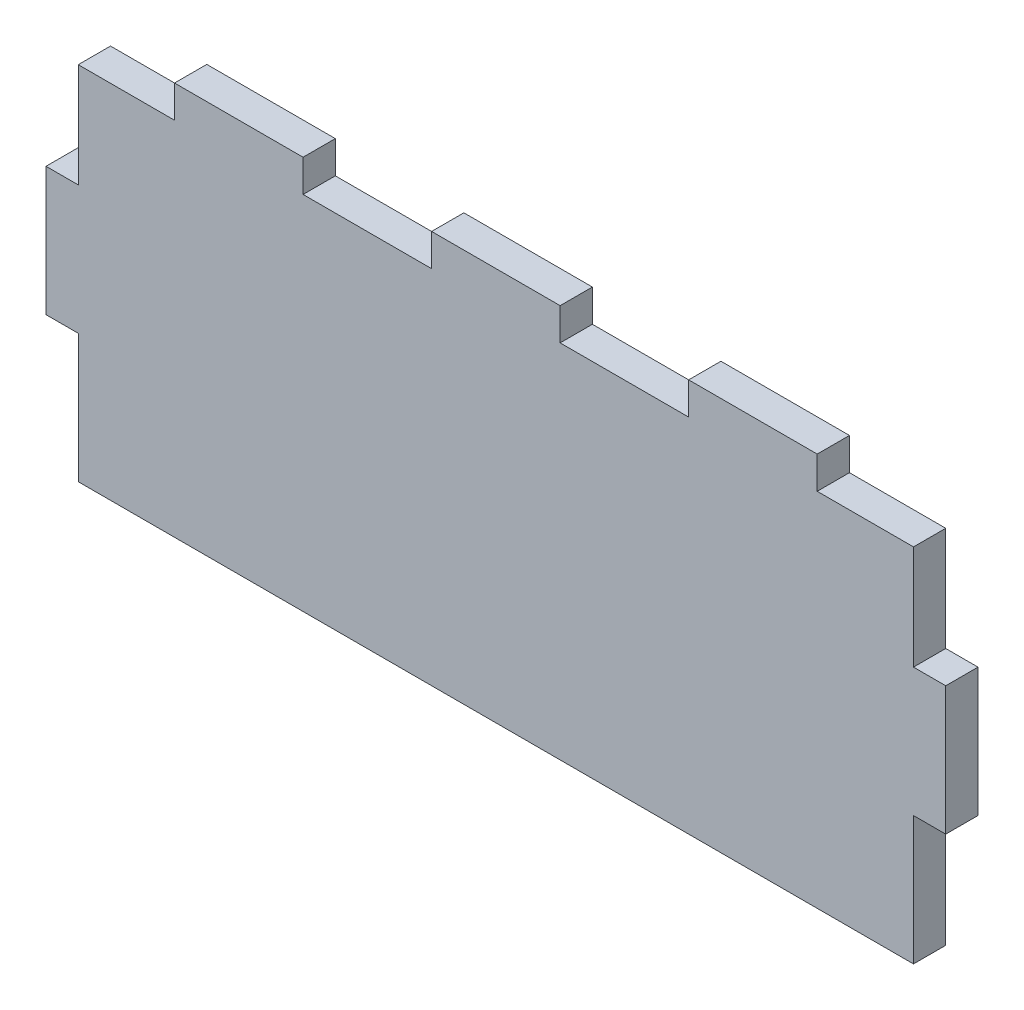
ISO-10303-21;
HEADER;
FILE_DESCRIPTION(('STEP AP214'),'2;1');
FILE_NAME('part.step','',(''),(''),'','','');
FILE_SCHEMA(('AUTOMOTIVE_DESIGN { 1 0 10303 214 1 1 1 1 }'));
ENDSEC;
DATA;
#1=APPLICATION_CONTEXT('core data for automotive mechanical design processes');
#2=APPLICATION_PROTOCOL_DEFINITION('international standard','automotive_design',2000,#1);
#3=PRODUCT_CONTEXT('',#1,'mechanical');
#4=PRODUCT('Part','Part','',(#3));
#5=PRODUCT_RELATED_PRODUCT_CATEGORY('part','',(#4));
#6=PRODUCT_DEFINITION_FORMATION('','',#4);
#7=PRODUCT_DEFINITION_CONTEXT('part definition',#1,'design');
#8=PRODUCT_DEFINITION('design','',#6,#7);
#9=PRODUCT_DEFINITION_SHAPE('','',#8);
#10=(LENGTH_UNIT() NAMED_UNIT(*) SI_UNIT(.MILLI.,.METRE.));
#11=(NAMED_UNIT(*) PLANE_ANGLE_UNIT() SI_UNIT($,.RADIAN.));
#12=(NAMED_UNIT(*) SI_UNIT($,.STERADIAN.) SOLID_ANGLE_UNIT());
#13=UNCERTAINTY_MEASURE_WITH_UNIT(LENGTH_MEASURE(1.E-05),#10,'distance_accuracy_value','');
#14=(GEOMETRIC_REPRESENTATION_CONTEXT(3) GLOBAL_UNCERTAINTY_ASSIGNED_CONTEXT((#13)) GLOBAL_UNIT_ASSIGNED_CONTEXT((#10,
#11,#12)) REPRESENTATION_CONTEXT('',''));
#15=CARTESIAN_POINT('',(0.,0.,0.));
#16=DIRECTION('',(0.,0.,1.));
#17=DIRECTION('',(1.,0.,0.));
#18=AXIS2_PLACEMENT_3D('',#15,#16,#17);
#19=CARTESIAN_POINT('',(-269.798887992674,150.110299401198,19.));
#20=DIRECTION('',(0.,-1.,0.));
#21=DIRECTION('',(1.,0.,0.));
#22=AXIS2_PLACEMENT_3D('',#19,#20,#21);
#23=PLANE('',#22);
#24=DIRECTION('',(-1.,0.,0.));
#25=VECTOR('',#24,1.);
#26=CARTESIAN_POINT('',(-269.798887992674,150.110299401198,0.));
#27=LINE('',#26,#25);
#28=CARTESIAN_POINT('',(-213.084601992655,150.110299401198,0.));
#29=VERTEX_POINT('',#28);
#30=CARTESIAN_POINT('',(-269.798887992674,150.110299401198,0.));
#31=VERTEX_POINT('',#30);
#32=EDGE_CURVE('E225',#29,#31,#27,.T.);
#33=ORIENTED_EDGE('',*,*,#32,.T.);
#34=DIRECTION('',(0.,0.,-1.));
#35=VECTOR('',#34,1.);
#36=CARTESIAN_POINT('',(-269.798887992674,150.110299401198,19.));
#37=LINE('',#36,#35);
#38=CARTESIAN_POINT('',(-269.798887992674,150.110299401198,19.));
#39=VERTEX_POINT('',#38);
#40=EDGE_CURVE('E11',#39,#31,#37,.T.);
#41=ORIENTED_EDGE('',*,*,#40,.F.);
#42=DIRECTION('',(-1.,0.,0.));
#43=VECTOR('',#42,1.);
#44=CARTESIAN_POINT('',(-269.798887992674,150.110299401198,19.));
#45=LINE('',#44,#43);
#46=CARTESIAN_POINT('',(-213.084601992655,150.110299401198,19.));
#47=VERTEX_POINT('',#46);
#48=EDGE_CURVE('E271',#47,#39,#45,.T.);
#49=ORIENTED_EDGE('',*,*,#48,.F.);
#50=DIRECTION('',(0.,0.,-1.));
#51=VECTOR('',#50,1.);
#52=CARTESIAN_POINT('',(-213.084601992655,150.110299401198,19.));
#53=LINE('',#52,#51);
#54=EDGE_CURVE('E221',#47,#29,#53,.T.);
#55=ORIENTED_EDGE('',*,*,#54,.T.);
#56=EDGE_LOOP('',(#33,#41,#49,#55));
#57=FACE_BOUND('',#56,.T.);
#58=ADVANCED_FACE('F33',(#57),#23,.F.);
#59=CARTESIAN_POINT('',(-269.798887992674,150.110299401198,19.));
#60=DIRECTION('',(1.,0.,0.));
#61=DIRECTION('',(0.,0.,-1.));
#62=AXIS2_PLACEMENT_3D('',#59,#60,#61);
#63=PLANE('',#62);
#64=DIRECTION('',(0.,-1.,0.));
#65=VECTOR('',#64,1.);
#66=CARTESIAN_POINT('',(-269.798887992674,150.110299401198,0.));
#67=LINE('',#66,#65);
#68=CARTESIAN_POINT('',(-269.798887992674,88.7788714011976,0.));
#69=VERTEX_POINT('',#68);
#70=EDGE_CURVE('E228',#31,#69,#67,.T.);
#71=ORIENTED_EDGE('',*,*,#70,.T.);
#72=DIRECTION('',(0.,0.,-1.));
#73=VECTOR('',#72,1.);
#74=CARTESIAN_POINT('',(-269.798887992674,88.7788714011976,19.));
#75=LINE('',#74,#73);
#76=CARTESIAN_POINT('',(-269.798887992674,88.7788714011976,19.));
#77=VERTEX_POINT('',#76);
#78=EDGE_CURVE('E41',#77,#69,#75,.T.);
#79=ORIENTED_EDGE('',*,*,#78,.F.);
#80=DIRECTION('',(0.,-1.,0.));
#81=VECTOR('',#80,1.);
#82=CARTESIAN_POINT('',(-269.798887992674,150.110299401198,19.));
#83=LINE('',#82,#81);
#84=EDGE_CURVE('E140',#39,#77,#83,.T.);
#85=ORIENTED_EDGE('',*,*,#84,.F.);
#86=ORIENTED_EDGE('',*,*,#40,.T.);
#87=EDGE_LOOP('',(#71,#79,#85,#86));
#88=FACE_BOUND('',#87,.T.);
#89=ADVANCED_FACE('F409',(#88),#63,.F.);
#90=CARTESIAN_POINT('',(-288.798887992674,88.7788714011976,19.));
#91=DIRECTION('',(0.,-1.,0.));
#92=DIRECTION('',(0.,0.,-1.));
#93=AXIS2_PLACEMENT_3D('',#90,#91,#92);
#94=PLANE('',#93);
#95=DIRECTION('',(-1.,0.,0.));
#96=VECTOR('',#95,1.);
#97=CARTESIAN_POINT('',(-288.798887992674,88.7788714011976,0.));
#98=LINE('',#97,#96);
#99=CARTESIAN_POINT('',(-288.798887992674,88.7788714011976,0.));
#100=VERTEX_POINT('',#99);
#101=EDGE_CURVE('E230',#69,#100,#98,.T.);
#102=ORIENTED_EDGE('',*,*,#101,.T.);
#103=DIRECTION('',(0.,0.,-1.));
#104=VECTOR('',#103,1.);
#105=CARTESIAN_POINT('',(-288.798887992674,88.7788714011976,19.));
#106=LINE('',#105,#104);
#107=CARTESIAN_POINT('',(-288.798887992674,88.7788714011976,19.));
#108=VERTEX_POINT('',#107);
#109=EDGE_CURVE('E326',#108,#100,#106,.T.);
#110=ORIENTED_EDGE('',*,*,#109,.F.);
#111=DIRECTION('',(-1.,0.,0.));
#112=VECTOR('',#111,1.);
#113=CARTESIAN_POINT('',(-288.798887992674,88.7788714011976,19.));
#114=LINE('',#113,#112);
#115=EDGE_CURVE('E334',#77,#108,#114,.T.);
#116=ORIENTED_EDGE('',*,*,#115,.F.);
#117=ORIENTED_EDGE('',*,*,#78,.T.);
#118=EDGE_LOOP('',(#102,#110,#116,#117));
#119=FACE_BOUND('',#118,.T.);
#120=ADVANCED_FACE('F332',(#119),#94,.F.);
#121=CARTESIAN_POINT('',(-288.798887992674,88.7788714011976,19.));
#122=DIRECTION('',(1.,0.,0.));
#123=DIRECTION('',(0.,0.,-1.));
#124=AXIS2_PLACEMENT_3D('',#121,#122,#123);
#125=PLANE('',#124);
#126=DIRECTION('',(0.,-1.,0.));
#127=VECTOR('',#126,1.);
#128=CARTESIAN_POINT('',(-288.798887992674,88.7788714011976,0.));
#129=LINE('',#128,#127);
#130=CARTESIAN_POINT('',(-288.798887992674,13.0645854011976,0.));
#131=VERTEX_POINT('',#130);
#132=EDGE_CURVE('E232',#100,#131,#129,.T.);
#133=ORIENTED_EDGE('',*,*,#132,.T.);
#134=DIRECTION('',(0.,0.,-1.));
#135=VECTOR('',#134,1.);
#136=CARTESIAN_POINT('',(-288.798887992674,13.0645854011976,19.));
#137=LINE('',#136,#135);
#138=CARTESIAN_POINT('',(-288.798887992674,13.0645854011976,19.));
#139=VERTEX_POINT('',#138);
#140=EDGE_CURVE('E323',#139,#131,#137,.T.);
#141=ORIENTED_EDGE('',*,*,#140,.F.);
#142=DIRECTION('',(0.,-1.,0.));
#143=VECTOR('',#142,1.);
#144=CARTESIAN_POINT('',(-288.798887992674,88.7788714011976,19.));
#145=LINE('',#144,#143);
#146=EDGE_CURVE('E352',#108,#139,#145,.T.);
#147=ORIENTED_EDGE('',*,*,#146,.F.);
#148=ORIENTED_EDGE('',*,*,#109,.T.);
#149=EDGE_LOOP('',(#133,#141,#147,#148));
#150=FACE_BOUND('',#149,.T.);
#151=ADVANCED_FACE('F343',(#150),#125,.F.);
#152=CARTESIAN_POINT('',(-288.798887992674,13.0645854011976,19.));
#153=DIRECTION('',(0.,1.,0.));
#154=DIRECTION('',(0.,0.,1.));
#155=AXIS2_PLACEMENT_3D('',#152,#153,#154);
#156=PLANE('',#155);
#157=DIRECTION('',(1.,0.,0.));
#158=VECTOR('',#157,1.);
#159=CARTESIAN_POINT('',(-288.798887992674,13.0645854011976,0.));
#160=LINE('',#159,#158);
#161=CARTESIAN_POINT('',(-269.798887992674,13.0645854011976,0.));
#162=VERTEX_POINT('',#161);
#163=EDGE_CURVE('E234',#131,#162,#160,.T.);
#164=ORIENTED_EDGE('',*,*,#163,.T.);
#165=DIRECTION('',(0.,0.,-1.));
#166=VECTOR('',#165,1.);
#167=CARTESIAN_POINT('',(-269.798887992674,13.0645854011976,19.));
#168=LINE('',#167,#166);
#169=CARTESIAN_POINT('',(-269.798887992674,13.0645854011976,19.));
#170=VERTEX_POINT('',#169);
#171=EDGE_CURVE('E320',#170,#162,#168,.T.);
#172=ORIENTED_EDGE('',*,*,#171,.F.);
#173=DIRECTION('',(1.,0.,0.));
#174=VECTOR('',#173,1.);
#175=CARTESIAN_POINT('',(-288.798887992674,13.0645854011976,19.));
#176=LINE('',#175,#174);
#177=EDGE_CURVE('E349',#139,#170,#176,.T.);
#178=ORIENTED_EDGE('',*,*,#177,.F.);
#179=ORIENTED_EDGE('',*,*,#140,.T.);
#180=EDGE_LOOP('',(#164,#172,#178,#179));
#181=FACE_BOUND('',#180,.T.);
#182=ADVANCED_FACE('F347',(#181),#156,.F.);
#183=CARTESIAN_POINT('',(-269.798887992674,13.0645854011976,19.));
#184=DIRECTION('',(1.,0.,0.));
#185=DIRECTION('',(0.,0.,-1.));
#186=AXIS2_PLACEMENT_3D('',#183,#184,#185);
#187=PLANE('',#186);
#188=DIRECTION('',(0.,-1.,0.));
#189=VECTOR('',#188,1.);
#190=CARTESIAN_POINT('',(-269.798887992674,13.0645854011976,0.));
#191=LINE('',#190,#189);
#192=CARTESIAN_POINT('',(-269.798887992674,-62.6497005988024,0.));
#193=VERTEX_POINT('',#192);
#194=EDGE_CURVE('E236',#162,#193,#191,.T.);
#195=ORIENTED_EDGE('',*,*,#194,.T.);
#196=DIRECTION('',(0.,0.,-1.));
#197=VECTOR('',#196,1.);
#198=CARTESIAN_POINT('',(-269.798887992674,-62.6497005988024,19.));
#199=LINE('',#198,#197);
#200=CARTESIAN_POINT('',(-269.798887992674,-62.6497005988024,19.));
#201=VERTEX_POINT('',#200);
#202=EDGE_CURVE('E317',#201,#193,#199,.T.);
#203=ORIENTED_EDGE('',*,*,#202,.F.);
#204=DIRECTION('',(0.,-1.,0.));
#205=VECTOR('',#204,1.);
#206=CARTESIAN_POINT('',(-269.798887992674,13.0645854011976,19.));
#207=LINE('',#206,#205);
#208=EDGE_CURVE('E351',#170,#201,#207,.T.);
#209=ORIENTED_EDGE('',*,*,#208,.F.);
#210=ORIENTED_EDGE('',*,*,#171,.T.);
#211=EDGE_LOOP('',(#195,#203,#209,#210));
#212=FACE_BOUND('',#211,.T.);
#213=ADVANCED_FACE('F422',(#212),#187,.F.);
#214=CARTESIAN_POINT('',(-269.798887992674,-62.6497005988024,19.));
#215=DIRECTION('',(0.,1.,0.));
#216=DIRECTION('',(-1.,0.,0.));
#217=AXIS2_PLACEMENT_3D('',#214,#215,#216);
#218=PLANE('',#217);
#219=DIRECTION('',(1.,0.,0.));
#220=VECTOR('',#219,1.);
#221=CARTESIAN_POINT('',(-269.798887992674,-62.6497005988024,0.));
#222=LINE('',#221,#220);
#223=CARTESIAN_POINT('',(222.201114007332,-62.6497005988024,0.));
#224=VERTEX_POINT('',#223);
#225=EDGE_CURVE('E238',#193,#224,#222,.T.);
#226=ORIENTED_EDGE('',*,*,#225,.T.);
#227=DIRECTION('',(0.,0.,-1.));
#228=VECTOR('',#227,1.);
#229=CARTESIAN_POINT('',(222.201114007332,-62.6497005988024,19.));
#230=LINE('',#229,#228);
#231=CARTESIAN_POINT('',(222.201114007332,-62.6497005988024,19.));
#232=VERTEX_POINT('',#231);
#233=EDGE_CURVE('E314',#232,#224,#230,.T.);
#234=ORIENTED_EDGE('',*,*,#233,.F.);
#235=DIRECTION('',(1.,0.,0.));
#236=VECTOR('',#235,1.);
#237=CARTESIAN_POINT('',(-269.798887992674,-62.6497005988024,19.));
#238=LINE('',#237,#236);
#239=EDGE_CURVE('E354',#201,#232,#238,.T.);
#240=ORIENTED_EDGE('',*,*,#239,.F.);
#241=ORIENTED_EDGE('',*,*,#202,.T.);
#242=EDGE_LOOP('',(#226,#234,#240,#241));
#243=FACE_BOUND('',#242,.T.);
#244=ADVANCED_FACE('F425',(#243),#218,.F.);
#245=CARTESIAN_POINT('',(222.201114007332,13.0645854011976,19.));
#246=DIRECTION('',(-1.,0.,0.));
#247=DIRECTION('',(0.,0.,1.));
#248=AXIS2_PLACEMENT_3D('',#245,#246,#247);
#249=PLANE('',#248);
#250=DIRECTION('',(0.,1.,0.));
#251=VECTOR('',#250,1.);
#252=CARTESIAN_POINT('',(222.201114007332,13.0645854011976,0.));
#253=LINE('',#252,#251);
#254=CARTESIAN_POINT('',(222.201114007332,13.0645854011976,0.));
#255=VERTEX_POINT('',#254);
#256=EDGE_CURVE('E240',#224,#255,#253,.T.);
#257=ORIENTED_EDGE('',*,*,#256,.T.);
#258=DIRECTION('',(0.,0.,-1.));
#259=VECTOR('',#258,1.);
#260=CARTESIAN_POINT('',(222.201114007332,13.0645854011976,19.));
#261=LINE('',#260,#259);
#262=CARTESIAN_POINT('',(222.201114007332,13.0645854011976,19.));
#263=VERTEX_POINT('',#262);
#264=EDGE_CURVE('E311',#263,#255,#261,.T.);
#265=ORIENTED_EDGE('',*,*,#264,.F.);
#266=DIRECTION('',(0.,1.,0.));
#267=VECTOR('',#266,1.);
#268=CARTESIAN_POINT('',(222.201114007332,13.0645854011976,19.));
#269=LINE('',#268,#267);
#270=EDGE_CURVE('E360',#232,#263,#269,.T.);
#271=ORIENTED_EDGE('',*,*,#270,.F.);
#272=ORIENTED_EDGE('',*,*,#233,.T.);
#273=EDGE_LOOP('',(#257,#265,#271,#272));
#274=FACE_BOUND('',#273,.T.);
#275=ADVANCED_FACE('F429',(#274),#249,.F.);
#276=CARTESIAN_POINT('',(222.201114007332,13.0645854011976,19.));
#277=DIRECTION('',(0.,1.,0.));
#278=DIRECTION('',(0.,0.,1.));
#279=AXIS2_PLACEMENT_3D('',#276,#277,#278);
#280=PLANE('',#279);
#281=DIRECTION('',(1.,0.,0.));
#282=VECTOR('',#281,1.);
#283=CARTESIAN_POINT('',(222.201114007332,13.0645854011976,0.));
#284=LINE('',#283,#282);
#285=CARTESIAN_POINT('',(241.201114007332,13.0645854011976,0.));
#286=VERTEX_POINT('',#285);
#287=EDGE_CURVE('E242',#255,#286,#284,.T.);
#288=ORIENTED_EDGE('',*,*,#287,.T.);
#289=DIRECTION('',(0.,0.,-1.));
#290=VECTOR('',#289,1.);
#291=CARTESIAN_POINT('',(241.201114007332,13.0645854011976,19.));
#292=LINE('',#291,#290);
#293=CARTESIAN_POINT('',(241.201114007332,13.0645854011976,19.));
#294=VERTEX_POINT('',#293);
#295=EDGE_CURVE('E308',#294,#286,#292,.T.);
#296=ORIENTED_EDGE('',*,*,#295,.F.);
#297=DIRECTION('',(1.,0.,0.));
#298=VECTOR('',#297,1.);
#299=CARTESIAN_POINT('',(222.201114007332,13.0645854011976,19.));
#300=LINE('',#299,#298);
#301=EDGE_CURVE('E362',#263,#294,#300,.T.);
#302=ORIENTED_EDGE('',*,*,#301,.F.);
#303=ORIENTED_EDGE('',*,*,#264,.T.);
#304=EDGE_LOOP('',(#288,#296,#302,#303));
#305=FACE_BOUND('',#304,.T.);
#306=ADVANCED_FACE('F433',(#305),#280,.F.);
#307=CARTESIAN_POINT('',(241.201114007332,88.7788714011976,19.));
#308=DIRECTION('',(-1.,0.,0.));
#309=DIRECTION('',(0.,0.,1.));
#310=AXIS2_PLACEMENT_3D('',#307,#308,#309);
#311=PLANE('',#310);
#312=DIRECTION('',(0.,1.,0.));
#313=VECTOR('',#312,1.);
#314=CARTESIAN_POINT('',(241.201114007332,88.7788714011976,0.));
#315=LINE('',#314,#313);
#316=CARTESIAN_POINT('',(241.201114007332,88.7788714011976,0.));
#317=VERTEX_POINT('',#316);
#318=EDGE_CURVE('E244',#286,#317,#315,.T.);
#319=ORIENTED_EDGE('',*,*,#318,.T.);
#320=DIRECTION('',(0.,0.,-1.));
#321=VECTOR('',#320,1.);
#322=CARTESIAN_POINT('',(241.201114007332,88.7788714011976,19.));
#323=LINE('',#322,#321);
#324=CARTESIAN_POINT('',(241.201114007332,88.7788714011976,19.));
#325=VERTEX_POINT('',#324);
#326=EDGE_CURVE('E305',#325,#317,#323,.T.);
#327=ORIENTED_EDGE('',*,*,#326,.F.);
#328=DIRECTION('',(0.,1.,0.));
#329=VECTOR('',#328,1.);
#330=CARTESIAN_POINT('',(241.201114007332,88.7788714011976,19.));
#331=LINE('',#330,#329);
#332=EDGE_CURVE('E364',#294,#325,#331,.T.);
#333=ORIENTED_EDGE('',*,*,#332,.F.);
#334=ORIENTED_EDGE('',*,*,#295,.T.);
#335=EDGE_LOOP('',(#319,#327,#333,#334));
#336=FACE_BOUND('',#335,.T.);
#337=ADVANCED_FACE('F437',(#336),#311,.F.);
#338=CARTESIAN_POINT('',(222.201114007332,88.7788714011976,19.));
#339=DIRECTION('',(0.,-1.,0.));
#340=DIRECTION('',(0.,0.,-1.));
#341=AXIS2_PLACEMENT_3D('',#338,#339,#340);
#342=PLANE('',#341);
#343=DIRECTION('',(-1.,0.,0.));
#344=VECTOR('',#343,1.);
#345=CARTESIAN_POINT('',(222.201114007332,88.7788714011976,0.));
#346=LINE('',#345,#344);
#347=CARTESIAN_POINT('',(222.201114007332,88.7788714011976,0.));
#348=VERTEX_POINT('',#347);
#349=EDGE_CURVE('E246',#317,#348,#346,.T.);
#350=ORIENTED_EDGE('',*,*,#349,.T.);
#351=DIRECTION('',(0.,0.,-1.));
#352=VECTOR('',#351,1.);
#353=CARTESIAN_POINT('',(222.201114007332,88.7788714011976,19.));
#354=LINE('',#353,#352);
#355=CARTESIAN_POINT('',(222.201114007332,88.7788714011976,19.));
#356=VERTEX_POINT('',#355);
#357=EDGE_CURVE('E302',#356,#348,#354,.T.);
#358=ORIENTED_EDGE('',*,*,#357,.F.);
#359=DIRECTION('',(-1.,0.,0.));
#360=VECTOR('',#359,1.);
#361=CARTESIAN_POINT('',(222.201114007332,88.7788714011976,19.));
#362=LINE('',#361,#360);
#363=EDGE_CURVE('E366',#325,#356,#362,.T.);
#364=ORIENTED_EDGE('',*,*,#363,.F.);
#365=ORIENTED_EDGE('',*,*,#326,.T.);
#366=EDGE_LOOP('',(#350,#358,#364,#365));
#367=FACE_BOUND('',#366,.T.);
#368=ADVANCED_FACE('F441',(#367),#342,.F.);
#369=CARTESIAN_POINT('',(222.201114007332,150.110299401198,19.));
#370=DIRECTION('',(-1.,0.,0.));
#371=DIRECTION('',(0.,0.,1.));
#372=AXIS2_PLACEMENT_3D('',#369,#370,#371);
#373=PLANE('',#372);
#374=DIRECTION('',(0.,1.,0.));
#375=VECTOR('',#374,1.);
#376=CARTESIAN_POINT('',(222.201114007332,150.110299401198,0.));
#377=LINE('',#376,#375);
#378=CARTESIAN_POINT('',(222.201114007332,150.110299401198,0.));
#379=VERTEX_POINT('',#378);
#380=EDGE_CURVE('E248',#348,#379,#377,.T.);
#381=ORIENTED_EDGE('',*,*,#380,.T.);
#382=DIRECTION('',(0.,0.,-1.));
#383=VECTOR('',#382,1.);
#384=CARTESIAN_POINT('',(222.201114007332,150.110299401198,19.));
#385=LINE('',#384,#383);
#386=CARTESIAN_POINT('',(222.201114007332,150.110299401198,19.));
#387=VERTEX_POINT('',#386);
#388=EDGE_CURVE('E299',#387,#379,#385,.T.);
#389=ORIENTED_EDGE('',*,*,#388,.F.);
#390=DIRECTION('',(0.,1.,0.));
#391=VECTOR('',#390,1.);
#392=CARTESIAN_POINT('',(222.201114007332,150.110299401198,19.));
#393=LINE('',#392,#391);
#394=EDGE_CURVE('E368',#356,#387,#393,.T.);
#395=ORIENTED_EDGE('',*,*,#394,.F.);
#396=ORIENTED_EDGE('',*,*,#357,.T.);
#397=EDGE_LOOP('',(#381,#389,#395,#396));
#398=FACE_BOUND('',#397,.T.);
#399=ADVANCED_FACE('F445',(#398),#373,.F.);
#400=CARTESIAN_POINT('',(165.486828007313,150.110299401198,19.));
#401=DIRECTION('',(0.,-1.,0.));
#402=DIRECTION('',(0.,0.,-1.));
#403=AXIS2_PLACEMENT_3D('',#400,#401,#402);
#404=PLANE('',#403);
#405=DIRECTION('',(-1.,0.,0.));
#406=VECTOR('',#405,1.);
#407=CARTESIAN_POINT('',(165.486828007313,150.110299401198,0.));
#408=LINE('',#407,#406);
#409=CARTESIAN_POINT('',(165.486828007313,150.110299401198,0.));
#410=VERTEX_POINT('',#409);
#411=EDGE_CURVE('E250',#379,#410,#408,.T.);
#412=ORIENTED_EDGE('',*,*,#411,.T.);
#413=DIRECTION('',(0.,0.,-1.));
#414=VECTOR('',#413,1.);
#415=CARTESIAN_POINT('',(165.486828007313,150.110299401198,19.));
#416=LINE('',#415,#414);
#417=CARTESIAN_POINT('',(165.486828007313,150.110299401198,19.));
#418=VERTEX_POINT('',#417);
#419=EDGE_CURVE('E296',#418,#410,#416,.T.);
#420=ORIENTED_EDGE('',*,*,#419,.F.);
#421=DIRECTION('',(-1.,0.,0.));
#422=VECTOR('',#421,1.);
#423=CARTESIAN_POINT('',(165.486828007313,150.110299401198,19.));
#424=LINE('',#423,#422);
#425=EDGE_CURVE('E370',#387,#418,#424,.T.);
#426=ORIENTED_EDGE('',*,*,#425,.F.);
#427=ORIENTED_EDGE('',*,*,#388,.T.);
#428=EDGE_LOOP('',(#412,#420,#426,#427));
#429=FACE_BOUND('',#428,.T.);
#430=ADVANCED_FACE('F449',(#429),#404,.F.);
#431=CARTESIAN_POINT('',(165.48682800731,169.110299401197,19.));
#432=DIRECTION('',(-1.,-1.606901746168E-13,0.));
#433=DIRECTION('',(1.606901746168E-13,-1.,0.));
#434=AXIS2_PLACEMENT_3D('',#431,#432,#433);
#435=PLANE('',#434);
#436=DIRECTION('',(-1.606901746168E-13,1.,0.));
#437=VECTOR('',#436,1.);
#438=CARTESIAN_POINT('',(165.48682800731,169.110299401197,0.));
#439=LINE('',#438,#437);
#440=CARTESIAN_POINT('',(165.48682800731,169.110299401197,0.));
#441=VERTEX_POINT('',#440);
#442=EDGE_CURVE('E252',#410,#441,#439,.T.);
#443=ORIENTED_EDGE('',*,*,#442,.T.);
#444=DIRECTION('',(0.,0.,-1.));
#445=VECTOR('',#444,1.);
#446=CARTESIAN_POINT('',(165.48682800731,169.110299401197,19.));
#447=LINE('',#446,#445);
#448=CARTESIAN_POINT('',(165.48682800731,169.110299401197,19.));
#449=VERTEX_POINT('',#448);
#450=EDGE_CURVE('E293',#449,#441,#447,.T.);
#451=ORIENTED_EDGE('',*,*,#450,.F.);
#452=DIRECTION('',(-1.606901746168E-13,1.,0.));
#453=VECTOR('',#452,1.);
#454=CARTESIAN_POINT('',(165.48682800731,169.110299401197,19.));
#455=LINE('',#454,#453);
#456=EDGE_CURVE('E372',#418,#449,#455,.T.);
#457=ORIENTED_EDGE('',*,*,#456,.F.);
#458=ORIENTED_EDGE('',*,*,#419,.T.);
#459=EDGE_LOOP('',(#443,#451,#457,#458));
#460=FACE_BOUND('',#459,.T.);
#461=ADVANCED_FACE('F453',(#460),#435,.F.);
#462=CARTESIAN_POINT('',(89.772542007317,169.110299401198,19.));
#463=DIRECTION('',(0.,-1.,0.));
#464=DIRECTION('',(1.,0.,0.));
#465=AXIS2_PLACEMENT_3D('',#462,#463,#464);
#466=PLANE('',#465);
#467=DIRECTION('',(-1.,0.,0.));
#468=VECTOR('',#467,1.);
#469=CARTESIAN_POINT('',(89.772542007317,169.110299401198,0.));
#470=LINE('',#469,#468);
#471=CARTESIAN_POINT('',(89.772542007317,169.110299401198,0.));
#472=VERTEX_POINT('',#471);
#473=EDGE_CURVE('E254',#441,#472,#470,.T.);
#474=ORIENTED_EDGE('',*,*,#473,.T.);
#475=DIRECTION('',(0.,0.,-1.));
#476=VECTOR('',#475,1.);
#477=CARTESIAN_POINT('',(89.772542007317,169.110299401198,19.));
#478=LINE('',#477,#476);
#479=CARTESIAN_POINT('',(89.772542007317,169.110299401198,19.));
#480=VERTEX_POINT('',#479);
#481=EDGE_CURVE('E290',#480,#472,#478,.T.);
#482=ORIENTED_EDGE('',*,*,#481,.F.);
#483=DIRECTION('',(-1.,0.,0.));
#484=VECTOR('',#483,1.);
#485=CARTESIAN_POINT('',(89.772542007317,169.110299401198,19.));
#486=LINE('',#485,#484);
#487=EDGE_CURVE('E374',#449,#480,#486,.T.);
#488=ORIENTED_EDGE('',*,*,#487,.F.);
#489=ORIENTED_EDGE('',*,*,#450,.T.);
#490=EDGE_LOOP('',(#474,#482,#488,#489));
#491=FACE_BOUND('',#490,.T.);
#492=ADVANCED_FACE('F457',(#491),#466,.F.);
#493=CARTESIAN_POINT('',(89.772542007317,169.110299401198,19.));
#494=DIRECTION('',(1.,0.,0.));
#495=DIRECTION('',(0.,1.,0.));
#496=AXIS2_PLACEMENT_3D('',#493,#494,#495);
#497=PLANE('',#496);
#498=DIRECTION('',(0.,-1.,0.));
#499=VECTOR('',#498,1.);
#500=CARTESIAN_POINT('',(89.772542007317,169.110299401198,0.));
#501=LINE('',#500,#499);
#502=CARTESIAN_POINT('',(89.7725420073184,150.110299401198,0.));
#503=VERTEX_POINT('',#502);
#504=EDGE_CURVE('E256',#472,#503,#501,.T.);
#505=ORIENTED_EDGE('',*,*,#504,.T.);
#506=DIRECTION('',(0.,0.,-1.));
#507=VECTOR('',#506,1.);
#508=CARTESIAN_POINT('',(89.7725420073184,150.110299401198,19.));
#509=LINE('',#508,#507);
#510=CARTESIAN_POINT('',(89.7725420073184,150.110299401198,19.));
#511=VERTEX_POINT('',#510);
#512=EDGE_CURVE('E287',#511,#503,#509,.T.);
#513=ORIENTED_EDGE('',*,*,#512,.F.);
#514=DIRECTION('',(0.,-1.,0.));
#515=VECTOR('',#514,1.);
#516=CARTESIAN_POINT('',(89.772542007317,169.110299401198,19.));
#517=LINE('',#516,#515);
#518=EDGE_CURVE('E376',#480,#511,#517,.T.);
#519=ORIENTED_EDGE('',*,*,#518,.F.);
#520=ORIENTED_EDGE('',*,*,#481,.T.);
#521=EDGE_LOOP('',(#505,#513,#519,#520));
#522=FACE_BOUND('',#521,.T.);
#523=ADVANCED_FACE('F461',(#522),#497,.F.);
#524=CARTESIAN_POINT('',(14.058256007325,150.110299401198,19.));
#525=DIRECTION('',(0.,-1.,0.));
#526=DIRECTION('',(0.,0.,-1.));
#527=AXIS2_PLACEMENT_3D('',#524,#525,#526);
#528=PLANE('',#527);
#529=DIRECTION('',(-1.,0.,0.));
#530=VECTOR('',#529,1.);
#531=CARTESIAN_POINT('',(14.058256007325,150.110299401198,0.));
#532=LINE('',#531,#530);
#533=CARTESIAN_POINT('',(14.058256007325,150.110299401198,0.));
#534=VERTEX_POINT('',#533);
#535=EDGE_CURVE('E258',#503,#534,#532,.T.);
#536=ORIENTED_EDGE('',*,*,#535,.T.);
#537=DIRECTION('',(0.,0.,-1.));
#538=VECTOR('',#537,1.);
#539=CARTESIAN_POINT('',(14.058256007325,150.110299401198,19.));
#540=LINE('',#539,#538);
#541=CARTESIAN_POINT('',(14.058256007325,150.110299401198,19.));
#542=VERTEX_POINT('',#541);
#543=EDGE_CURVE('E284',#542,#534,#540,.T.);
#544=ORIENTED_EDGE('',*,*,#543,.F.);
#545=DIRECTION('',(-1.,0.,0.));
#546=VECTOR('',#545,1.);
#547=CARTESIAN_POINT('',(14.058256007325,150.110299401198,19.));
#548=LINE('',#547,#546);
#549=EDGE_CURVE('E378',#511,#542,#548,.T.);
#550=ORIENTED_EDGE('',*,*,#549,.F.);
#551=ORIENTED_EDGE('',*,*,#512,.T.);
#552=EDGE_LOOP('',(#536,#544,#550,#551));
#553=FACE_BOUND('',#552,.T.);
#554=ADVANCED_FACE('F465',(#553),#528,.F.);
#555=CARTESIAN_POINT('',(14.0582560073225,169.110299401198,19.));
#556=DIRECTION('',(-1.,-1.32204189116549E-13,0.));
#557=DIRECTION('',(1.32204189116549E-13,-1.,0.));
#558=AXIS2_PLACEMENT_3D('',#555,#556,#557);
#559=PLANE('',#558);
#560=DIRECTION('',(-1.32204189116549E-13,1.,0.));
#561=VECTOR('',#560,1.);
#562=CARTESIAN_POINT('',(14.0582560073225,169.110299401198,0.));
#563=LINE('',#562,#561);
#564=CARTESIAN_POINT('',(14.0582560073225,169.110299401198,0.));
#565=VERTEX_POINT('',#564);
#566=EDGE_CURVE('E260',#534,#565,#563,.T.);
#567=ORIENTED_EDGE('',*,*,#566,.T.);
#568=DIRECTION('',(0.,0.,-1.));
#569=VECTOR('',#568,1.);
#570=CARTESIAN_POINT('',(14.0582560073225,169.110299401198,19.));
#571=LINE('',#570,#569);
#572=CARTESIAN_POINT('',(14.0582560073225,169.110299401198,19.));
#573=VERTEX_POINT('',#572);
#574=EDGE_CURVE('E281',#573,#565,#571,.T.);
#575=ORIENTED_EDGE('',*,*,#574,.F.);
#576=DIRECTION('',(-1.32204189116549E-13,1.,0.));
#577=VECTOR('',#576,1.);
#578=CARTESIAN_POINT('',(14.0582560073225,169.110299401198,19.));
#579=LINE('',#578,#577);
#580=EDGE_CURVE('E380',#542,#573,#579,.T.);
#581=ORIENTED_EDGE('',*,*,#580,.F.);
#582=ORIENTED_EDGE('',*,*,#543,.T.);
#583=EDGE_LOOP('',(#567,#575,#581,#582));
#584=FACE_BOUND('',#583,.T.);
#585=ADVANCED_FACE('F469',(#584),#559,.F.);
#586=CARTESIAN_POINT('',(-61.6560299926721,169.110299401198,19.));
#587=DIRECTION('',(0.,-1.,0.));
#588=DIRECTION('',(0.,0.,-1.));
#589=AXIS2_PLACEMENT_3D('',#586,#587,#588);
#590=PLANE('',#589);
#591=DIRECTION('',(-1.,0.,0.));
#592=VECTOR('',#591,1.);
#593=CARTESIAN_POINT('',(-61.6560299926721,169.110299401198,0.));
#594=LINE('',#593,#592);
#595=CARTESIAN_POINT('',(-61.6560299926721,169.110299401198,0.));
#596=VERTEX_POINT('',#595);
#597=EDGE_CURVE('E262',#565,#596,#594,.T.);
#598=ORIENTED_EDGE('',*,*,#597,.T.);
#599=DIRECTION('',(0.,0.,-1.));
#600=VECTOR('',#599,1.);
#601=CARTESIAN_POINT('',(-61.6560299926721,169.110299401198,19.));
#602=LINE('',#601,#600);
#603=CARTESIAN_POINT('',(-61.6560299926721,169.110299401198,19.));
#604=VERTEX_POINT('',#603);
#605=EDGE_CURVE('E278',#604,#596,#602,.T.);
#606=ORIENTED_EDGE('',*,*,#605,.F.);
#607=DIRECTION('',(-1.,0.,0.));
#608=VECTOR('',#607,1.);
#609=CARTESIAN_POINT('',(-61.6560299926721,169.110299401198,19.));
#610=LINE('',#609,#608);
#611=EDGE_CURVE('E382',#573,#604,#610,.T.);
#612=ORIENTED_EDGE('',*,*,#611,.F.);
#613=ORIENTED_EDGE('',*,*,#574,.T.);
#614=EDGE_LOOP('',(#598,#606,#612,#613));
#615=FACE_BOUND('',#614,.T.);
#616=ADVANCED_FACE('F473',(#615),#590,.F.);
#617=CARTESIAN_POINT('',(-61.6560299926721,169.110299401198,19.));
#618=DIRECTION('',(1.,1.96480258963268E-13,0.));
#619=DIRECTION('',(-1.96480258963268E-13,1.,0.));
#620=AXIS2_PLACEMENT_3D('',#617,#618,#619);
#621=PLANE('',#620);
#622=DIRECTION('',(1.96480258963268E-13,-1.,0.));
#623=VECTOR('',#622,1.);
#624=CARTESIAN_POINT('',(-61.6560299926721,169.110299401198,0.));
#625=LINE('',#624,#623);
#626=CARTESIAN_POINT('',(-61.6560299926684,150.110299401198,0.));
#627=VERTEX_POINT('',#626);
#628=EDGE_CURVE('E264',#596,#627,#625,.T.);
#629=ORIENTED_EDGE('',*,*,#628,.T.);
#630=DIRECTION('',(0.,0.,-1.));
#631=VECTOR('',#630,1.);
#632=CARTESIAN_POINT('',(-61.6560299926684,150.110299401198,19.));
#633=LINE('',#632,#631);
#634=CARTESIAN_POINT('',(-61.6560299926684,150.110299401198,19.));
#635=VERTEX_POINT('',#634);
#636=EDGE_CURVE('E275',#635,#627,#633,.T.);
#637=ORIENTED_EDGE('',*,*,#636,.F.);
#638=DIRECTION('',(1.96480258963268E-13,-1.,0.));
#639=VECTOR('',#638,1.);
#640=CARTESIAN_POINT('',(-61.6560299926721,169.110299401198,19.));
#641=LINE('',#640,#639);
#642=EDGE_CURVE('E384',#604,#635,#641,.T.);
#643=ORIENTED_EDGE('',*,*,#642,.F.);
#644=ORIENTED_EDGE('',*,*,#605,.T.);
#645=EDGE_LOOP('',(#629,#637,#643,#644));
#646=FACE_BOUND('',#645,.T.);
#647=ADVANCED_FACE('F390',(#646),#621,.F.);
#648=CARTESIAN_POINT('',(-137.370315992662,150.110299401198,19.));
#649=DIRECTION('',(0.,-1.,0.));
#650=DIRECTION('',(0.,0.,-1.));
#651=AXIS2_PLACEMENT_3D('',#648,#649,#650);
#652=PLANE('',#651);
#653=DIRECTION('',(-1.,0.,0.));
#654=VECTOR('',#653,1.);
#655=CARTESIAN_POINT('',(-137.370315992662,150.110299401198,0.));
#656=LINE('',#655,#654);
#657=CARTESIAN_POINT('',(-137.370315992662,150.110299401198,0.));
#658=VERTEX_POINT('',#657);
#659=EDGE_CURVE('E266',#627,#658,#656,.T.);
#660=ORIENTED_EDGE('',*,*,#659,.T.);
#661=DIRECTION('',(0.,0.,-1.));
#662=VECTOR('',#661,1.);
#663=CARTESIAN_POINT('',(-137.370315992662,150.110299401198,19.));
#664=LINE('',#663,#662);
#665=CARTESIAN_POINT('',(-137.370315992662,150.110299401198,19.));
#666=VERTEX_POINT('',#665);
#667=EDGE_CURVE('E216',#666,#658,#664,.T.);
#668=ORIENTED_EDGE('',*,*,#667,.F.);
#669=DIRECTION('',(-1.,0.,0.));
#670=VECTOR('',#669,1.);
#671=CARTESIAN_POINT('',(-137.370315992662,150.110299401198,19.));
#672=LINE('',#671,#670);
#673=EDGE_CURVE('E207',#635,#666,#672,.T.);
#674=ORIENTED_EDGE('',*,*,#673,.F.);
#675=ORIENTED_EDGE('',*,*,#636,.T.);
#676=EDGE_LOOP('',(#660,#668,#674,#675));
#677=FACE_BOUND('',#676,.T.);
#678=ADVANCED_FACE('F394',(#677),#652,.F.);
#679=CARTESIAN_POINT('',(-137.370315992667,169.110299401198,19.));
#680=DIRECTION('',(-1.,-2.60025918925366E-13,0.));
#681=DIRECTION('',(2.60025918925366E-13,-1.,0.));
#682=AXIS2_PLACEMENT_3D('',#679,#680,#681);
#683=PLANE('',#682);
#684=DIRECTION('',(-2.60025918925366E-13,1.,0.));
#685=VECTOR('',#684,1.);
#686=CARTESIAN_POINT('',(-137.370315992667,169.110299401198,0.));
#687=LINE('',#686,#685);
#688=CARTESIAN_POINT('',(-137.370315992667,169.110299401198,0.));
#689=VERTEX_POINT('',#688);
#690=EDGE_CURVE('E215',#658,#689,#687,.T.);
#691=ORIENTED_EDGE('',*,*,#690,.T.);
#692=DIRECTION('',(0.,0.,-1.));
#693=VECTOR('',#692,1.);
#694=CARTESIAN_POINT('',(-137.370315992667,169.110299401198,19.));
#695=LINE('',#694,#693);
#696=CARTESIAN_POINT('',(-137.370315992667,169.110299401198,19.));
#697=VERTEX_POINT('',#696);
#698=EDGE_CURVE('E212',#697,#689,#695,.T.);
#699=ORIENTED_EDGE('',*,*,#698,.F.);
#700=DIRECTION('',(-2.60025918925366E-13,1.,0.));
#701=VECTOR('',#700,1.);
#702=CARTESIAN_POINT('',(-137.370315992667,169.110299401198,19.));
#703=LINE('',#702,#701);
#704=EDGE_CURVE('E201',#666,#697,#703,.T.);
#705=ORIENTED_EDGE('',*,*,#704,.F.);
#706=ORIENTED_EDGE('',*,*,#667,.T.);
#707=EDGE_LOOP('',(#691,#699,#705,#706));
#708=FACE_BOUND('',#707,.T.);
#709=ADVANCED_FACE('F213',(#708),#683,.F.);
#710=CARTESIAN_POINT('',(-213.084601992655,169.110299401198,19.));
#711=DIRECTION('',(0.,-1.,0.));
#712=DIRECTION('',(0.,0.,-1.));
#713=AXIS2_PLACEMENT_3D('',#710,#711,#712);
#714=PLANE('',#713);
#715=DIRECTION('',(-1.,0.,0.));
#716=VECTOR('',#715,1.);
#717=CARTESIAN_POINT('',(-213.084601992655,169.110299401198,0.));
#718=LINE('',#717,#716);
#719=CARTESIAN_POINT('',(-213.084601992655,169.110299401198,0.));
#720=VERTEX_POINT('',#719);
#721=EDGE_CURVE('E126',#689,#720,#718,.T.);
#722=ORIENTED_EDGE('',*,*,#721,.T.);
#723=DIRECTION('',(0.,0.,-1.));
#724=VECTOR('',#723,1.);
#725=CARTESIAN_POINT('',(-213.084601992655,169.110299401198,19.));
#726=LINE('',#725,#724);
#727=CARTESIAN_POINT('',(-213.084601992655,169.110299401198,19.));
#728=VERTEX_POINT('',#727);
#729=EDGE_CURVE('E217',#728,#720,#726,.T.);
#730=ORIENTED_EDGE('',*,*,#729,.F.);
#731=DIRECTION('',(-1.,0.,0.));
#732=VECTOR('',#731,1.);
#733=CARTESIAN_POINT('',(-213.084601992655,169.110299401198,19.));
#734=LINE('',#733,#732);
#735=EDGE_CURVE('E205',#697,#728,#734,.T.);
#736=ORIENTED_EDGE('',*,*,#735,.F.);
#737=ORIENTED_EDGE('',*,*,#698,.T.);
#738=EDGE_LOOP('',(#722,#730,#736,#737));
#739=FACE_BOUND('',#738,.T.);
#740=ADVANCED_FACE('F219',(#739),#714,.F.);
#741=CARTESIAN_POINT('',(-213.084601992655,169.110299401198,19.));
#742=DIRECTION('',(1.,0.,0.));
#743=DIRECTION('',(0.,0.,-1.));
#744=AXIS2_PLACEMENT_3D('',#741,#742,#743);
#745=PLANE('',#744);
#746=DIRECTION('',(0.,-1.,0.));
#747=VECTOR('',#746,1.);
#748=CARTESIAN_POINT('',(-213.084601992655,169.110299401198,0.));
#749=LINE('',#748,#747);
#750=EDGE_CURVE('E132',#720,#29,#749,.T.);
#751=ORIENTED_EDGE('',*,*,#750,.T.);
#752=ORIENTED_EDGE('',*,*,#54,.F.);
#753=DIRECTION('',(0.,-1.,0.));
#754=VECTOR('',#753,1.);
#755=CARTESIAN_POINT('',(-213.084601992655,169.110299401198,19.));
#756=LINE('',#755,#754);
#757=EDGE_CURVE('E49',#728,#47,#756,.T.);
#758=ORIENTED_EDGE('',*,*,#757,.F.);
#759=ORIENTED_EDGE('',*,*,#729,.T.);
#760=EDGE_LOOP('',(#751,#752,#758,#759));
#761=FACE_BOUND('',#760,.T.);
#762=ADVANCED_FACE('F398',(#761),#745,.F.);
#763=CARTESIAN_POINT('',(0.,0.,19.));
#764=DIRECTION('',(0.,0.,-1.));
#765=DIRECTION('',(-1.,0.,0.));
#766=AXIS2_PLACEMENT_3D('',#763,#764,#765);
#767=PLANE('',#766);
#768=ORIENTED_EDGE('',*,*,#48,.T.);
#769=ORIENTED_EDGE('',*,*,#84,.T.);
#770=ORIENTED_EDGE('',*,*,#115,.T.);
#771=ORIENTED_EDGE('',*,*,#146,.T.);
#772=ORIENTED_EDGE('',*,*,#177,.T.);
#773=ORIENTED_EDGE('',*,*,#208,.T.);
#774=ORIENTED_EDGE('',*,*,#239,.T.);
#775=ORIENTED_EDGE('',*,*,#270,.T.);
#776=ORIENTED_EDGE('',*,*,#301,.T.);
#777=ORIENTED_EDGE('',*,*,#332,.T.);
#778=ORIENTED_EDGE('',*,*,#363,.T.);
#779=ORIENTED_EDGE('',*,*,#394,.T.);
#780=ORIENTED_EDGE('',*,*,#425,.T.);
#781=ORIENTED_EDGE('',*,*,#456,.T.);
#782=ORIENTED_EDGE('',*,*,#487,.T.);
#783=ORIENTED_EDGE('',*,*,#518,.T.);
#784=ORIENTED_EDGE('',*,*,#549,.T.);
#785=ORIENTED_EDGE('',*,*,#580,.T.);
#786=ORIENTED_EDGE('',*,*,#611,.T.);
#787=ORIENTED_EDGE('',*,*,#642,.T.);
#788=ORIENTED_EDGE('',*,*,#673,.T.);
#789=ORIENTED_EDGE('',*,*,#704,.T.);
#790=ORIENTED_EDGE('',*,*,#735,.T.);
#791=ORIENTED_EDGE('',*,*,#757,.T.);
#792=EDGE_LOOP('',(#768,#769,#770,#771,#772,#773,#774,#775,#776,#777,#778,#779,#780,#781,#782,
#783,#784,#785,#786,#787,#788,#789,#790,#791));
#793=FACE_BOUND('',#792,.T.);
#794=ADVANCED_FACE('F203',(#793),#767,.F.);
#795=CARTESIAN_POINT('',(0.,0.,0.));
#796=DIRECTION('',(0.,0.,-1.));
#797=DIRECTION('',(-1.,0.,0.));
#798=AXIS2_PLACEMENT_3D('',#795,#796,#797);
#799=PLANE('',#798);
#800=ORIENTED_EDGE('',*,*,#32,.F.);
#801=ORIENTED_EDGE('',*,*,#750,.F.);
#802=ORIENTED_EDGE('',*,*,#721,.F.);
#803=ORIENTED_EDGE('',*,*,#690,.F.);
#804=ORIENTED_EDGE('',*,*,#659,.F.);
#805=ORIENTED_EDGE('',*,*,#628,.F.);
#806=ORIENTED_EDGE('',*,*,#597,.F.);
#807=ORIENTED_EDGE('',*,*,#566,.F.);
#808=ORIENTED_EDGE('',*,*,#535,.F.);
#809=ORIENTED_EDGE('',*,*,#504,.F.);
#810=ORIENTED_EDGE('',*,*,#473,.F.);
#811=ORIENTED_EDGE('',*,*,#442,.F.);
#812=ORIENTED_EDGE('',*,*,#411,.F.);
#813=ORIENTED_EDGE('',*,*,#380,.F.);
#814=ORIENTED_EDGE('',*,*,#349,.F.);
#815=ORIENTED_EDGE('',*,*,#318,.F.);
#816=ORIENTED_EDGE('',*,*,#287,.F.);
#817=ORIENTED_EDGE('',*,*,#256,.F.);
#818=ORIENTED_EDGE('',*,*,#225,.F.);
#819=ORIENTED_EDGE('',*,*,#194,.F.);
#820=ORIENTED_EDGE('',*,*,#163,.F.);
#821=ORIENTED_EDGE('',*,*,#132,.F.);
#822=ORIENTED_EDGE('',*,*,#101,.F.);
#823=ORIENTED_EDGE('',*,*,#70,.F.);
#824=EDGE_LOOP('',(#800,#801,#802,#803,#804,#805,#806,#807,#808,#809,#810,#811,#812,#813,#814,
#815,#816,#817,#818,#819,#820,#821,#822,#823));
#825=FACE_BOUND('',#824,.T.);
#826=ADVANCED_FACE('F338',(#825),#799,.T.);
#827=CLOSED_SHELL('',(#58,#89,#120,#151,#182,#213,#244,#275,#306,#337,#368,#399,#430,#461,#492,
#523,#554,#585,#616,#647,#678,#709,#740,#762,#794,#826));
#828=MANIFOLD_SOLID_BREP('B2',#827);
#829=ADVANCED_BREP_SHAPE_REPRESENTATION('',(#18,#828),#14);
#830=SHAPE_DEFINITION_REPRESENTATION(#9,#829);
ENDSEC;
END-ISO-10303-21;
